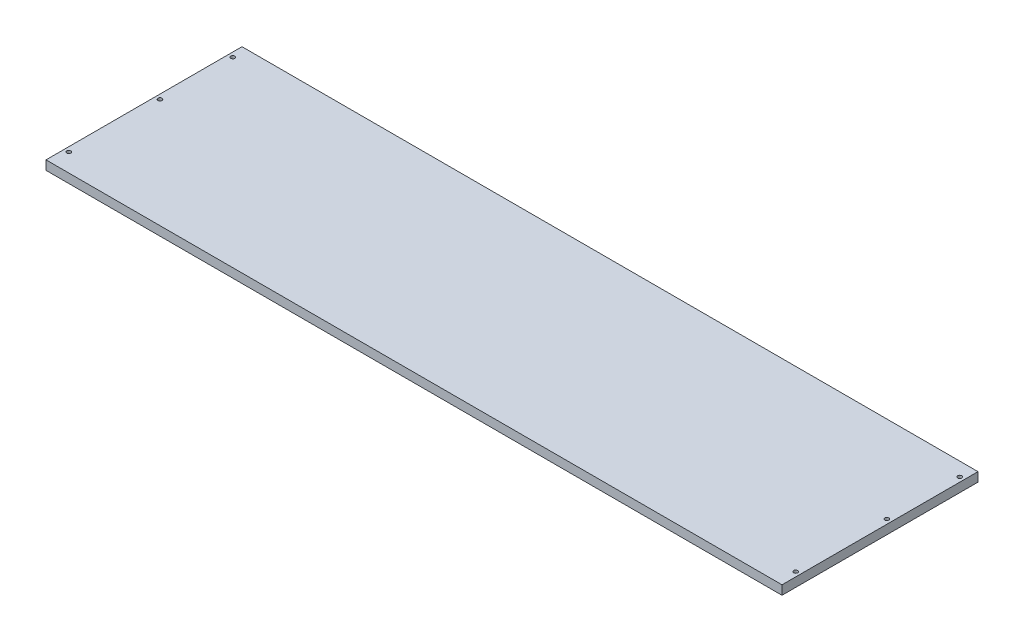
ISO-10303-21;
HEADER;
FILE_DESCRIPTION(('STEP AP214'),'2;1');
FILE_NAME('part.step','',(''),(''),'','','');
FILE_SCHEMA(('AUTOMOTIVE_DESIGN { 1 0 10303 214 1 1 1 1 }'));
ENDSEC;
DATA;
#1=APPLICATION_CONTEXT('core data for automotive mechanical design processes');
#2=APPLICATION_PROTOCOL_DEFINITION('international standard','automotive_design',2000,#1);
#3=PRODUCT_CONTEXT('',#1,'mechanical');
#4=PRODUCT('Part','Part','',(#3));
#5=PRODUCT_RELATED_PRODUCT_CATEGORY('part','',(#4));
#6=PRODUCT_DEFINITION_FORMATION('','',#4);
#7=PRODUCT_DEFINITION_CONTEXT('part definition',#1,'design');
#8=PRODUCT_DEFINITION('design','',#6,#7);
#9=PRODUCT_DEFINITION_SHAPE('','',#8);
#10=(LENGTH_UNIT() NAMED_UNIT(*) SI_UNIT(.MILLI.,.METRE.));
#11=(NAMED_UNIT(*) PLANE_ANGLE_UNIT() SI_UNIT($,.RADIAN.));
#12=(NAMED_UNIT(*) SI_UNIT($,.STERADIAN.) SOLID_ANGLE_UNIT());
#13=UNCERTAINTY_MEASURE_WITH_UNIT(LENGTH_MEASURE(1.E-05),#10,'distance_accuracy_value','');
#14=(GEOMETRIC_REPRESENTATION_CONTEXT(3) GLOBAL_UNCERTAINTY_ASSIGNED_CONTEXT((#13)) GLOBAL_UNIT_ASSIGNED_CONTEXT((#10,
#11,#12)) REPRESENTATION_CONTEXT('',''));
#15=CARTESIAN_POINT('',(0.,0.,0.));
#16=DIRECTION('',(0.,0.,1.));
#17=DIRECTION('',(1.,0.,0.));
#18=AXIS2_PLACEMENT_3D('',#15,#16,#17);
#19=CARTESIAN_POINT('',(0.,12.7,0.));
#20=DIRECTION('',(1.,0.,0.));
#21=DIRECTION('',(0.,0.,-1.));
#22=AXIS2_PLACEMENT_3D('',#19,#20,#21);
#23=PLANE('',#22);
#24=DIRECTION('',(0.,0.,1.));
#25=VECTOR('',#24,1.);
#26=CARTESIAN_POINT('',(0.,12.7,0.));
#27=LINE('',#26,#25);
#28=CARTESIAN_POINT('',(0.,12.7,-273.05));
#29=VERTEX_POINT('',#28);
#30=CARTESIAN_POINT('',(0.,12.7,0.));
#31=VERTEX_POINT('',#30);
#32=EDGE_CURVE('E84',#29,#31,#27,.T.);
#33=ORIENTED_EDGE('',*,*,#32,.F.);
#34=DIRECTION('',(0.,-1.,0.));
#35=VECTOR('',#34,1.);
#36=CARTESIAN_POINT('',(0.,12.7,-273.05));
#37=LINE('',#36,#35);
#38=CARTESIAN_POINT('',(0.,0.,-273.05));
#39=VERTEX_POINT('',#38);
#40=EDGE_CURVE('E125',#29,#39,#37,.T.);
#41=ORIENTED_EDGE('',*,*,#40,.T.);
#42=DIRECTION('',(0.,0.,1.));
#43=VECTOR('',#42,1.);
#44=CARTESIAN_POINT('',(0.,0.,0.));
#45=LINE('',#44,#43);
#46=CARTESIAN_POINT('',(0.,0.,0.));
#47=VERTEX_POINT('',#46);
#48=EDGE_CURVE('E75',#39,#47,#45,.T.);
#49=ORIENTED_EDGE('',*,*,#48,.T.);
#50=DIRECTION('',(0.,-1.,0.));
#51=VECTOR('',#50,1.);
#52=CARTESIAN_POINT('',(0.,12.7,0.));
#53=LINE('',#52,#51);
#54=EDGE_CURVE('E37',#31,#47,#53,.T.);
#55=ORIENTED_EDGE('',*,*,#54,.F.);
#56=EDGE_LOOP('',(#33,#41,#49,#55));
#57=FACE_BOUND('',#56,.T.);
#58=ADVANCED_FACE('F30',(#57),#23,.F.);
#59=CARTESIAN_POINT('',(0.,12.7,0.));
#60=DIRECTION('',(0.,0.,-1.));
#61=DIRECTION('',(-1.,0.,0.));
#62=AXIS2_PLACEMENT_3D('',#59,#60,#61);
#63=PLANE('',#62);
#64=DIRECTION('',(1.,0.,0.));
#65=VECTOR('',#64,1.);
#66=CARTESIAN_POINT('',(0.,0.,0.));
#67=LINE('',#66,#65);
#68=CARTESIAN_POINT('',(1025.398,0.,0.));
#69=VERTEX_POINT('',#68);
#70=EDGE_CURVE('E65',#47,#69,#67,.T.);
#71=ORIENTED_EDGE('',*,*,#70,.T.);
#72=DIRECTION('',(0.,-1.,0.));
#73=VECTOR('',#72,1.);
#74=CARTESIAN_POINT('',(1025.398,12.7,0.));
#75=LINE('',#74,#73);
#76=CARTESIAN_POINT('',(1025.398,12.7,0.));
#77=VERTEX_POINT('',#76);
#78=EDGE_CURVE('E68',#77,#69,#75,.T.);
#79=ORIENTED_EDGE('',*,*,#78,.F.);
#80=DIRECTION('',(1.,0.,0.));
#81=VECTOR('',#80,1.);
#82=CARTESIAN_POINT('',(0.,12.7,0.));
#83=LINE('',#82,#81);
#84=EDGE_CURVE('E52',#31,#77,#83,.T.);
#85=ORIENTED_EDGE('',*,*,#84,.F.);
#86=ORIENTED_EDGE('',*,*,#54,.T.);
#87=EDGE_LOOP('',(#71,#79,#85,#86));
#88=FACE_BOUND('',#87,.T.);
#89=ADVANCED_FACE('F67',(#88),#63,.F.);
#90=CARTESIAN_POINT('',(1025.398,12.7,0.));
#91=DIRECTION('',(-1.,0.,0.));
#92=DIRECTION('',(0.,0.,1.));
#93=AXIS2_PLACEMENT_3D('',#90,#91,#92);
#94=PLANE('',#93);
#95=DIRECTION('',(0.,0.,-1.));
#96=VECTOR('',#95,1.);
#97=CARTESIAN_POINT('',(1025.398,0.,0.));
#98=LINE('',#97,#96);
#99=CARTESIAN_POINT('',(1025.398,0.,-273.05));
#100=VERTEX_POINT('',#99);
#101=EDGE_CURVE('E74',#69,#100,#98,.T.);
#102=ORIENTED_EDGE('',*,*,#101,.T.);
#103=DIRECTION('',(0.,1.,0.));
#104=VECTOR('',#103,1.);
#105=CARTESIAN_POINT('',(1025.398,12.7,-273.05));
#106=LINE('',#105,#104);
#107=CARTESIAN_POINT('',(1025.398,12.7,-273.05));
#108=VERTEX_POINT('',#107);
#109=EDGE_CURVE('E43',#100,#108,#106,.T.);
#110=ORIENTED_EDGE('',*,*,#109,.T.);
#111=DIRECTION('',(0.,0.,-1.));
#112=VECTOR('',#111,1.);
#113=CARTESIAN_POINT('',(1025.398,12.7,0.));
#114=LINE('',#113,#112);
#115=EDGE_CURVE('E80',#77,#108,#114,.T.);
#116=ORIENTED_EDGE('',*,*,#115,.F.);
#117=ORIENTED_EDGE('',*,*,#78,.T.);
#118=EDGE_LOOP('',(#102,#110,#116,#117));
#119=FACE_BOUND('',#118,.T.);
#120=ADVANCED_FACE('F79',(#119),#94,.F.);
#121=CARTESIAN_POINT('',(0.,12.7,-304.8));
#122=DIRECTION('',(0.,-1.,0.));
#123=DIRECTION('',(0.,0.,-1.));
#124=AXIS2_PLACEMENT_3D('',#121,#122,#123);
#125=PLANE('',#124);
#126=CARTESIAN_POINT('',(6.35000000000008,12.7,-25.3999999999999));
#127=DIRECTION('',(0.,1.,0.));
#128=DIRECTION('',(0.,0.,1.));
#129=AXIS2_PLACEMENT_3D('',#126,#127,#128);
#130=CIRCLE('',#129,2.80669999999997);
#131=CARTESIAN_POINT('',(6.35000000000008,12.7,-22.5932999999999));
#132=VERTEX_POINT('',#131);
#133=EDGE_CURVE('E122',#132,#132,#130,.T.);
#134=ORIENTED_EDGE('',*,*,#133,.F.);
#135=EDGE_LOOP('',(#134));
#136=FACE_BOUND('',#135,.T.);
#137=CARTESIAN_POINT('',(1019.048,12.7,-25.3999999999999));
#138=DIRECTION('',(0.,1.,0.));
#139=DIRECTION('',(0.,0.,-1.));
#140=AXIS2_PLACEMENT_3D('',#137,#138,#139);
#141=CIRCLE('',#140,2.80669999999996);
#142=CARTESIAN_POINT('',(1019.048,12.7,-28.2066999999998));
#143=VERTEX_POINT('',#142);
#144=EDGE_CURVE('E116',#143,#143,#141,.T.);
#145=ORIENTED_EDGE('',*,*,#144,.F.);
#146=EDGE_LOOP('',(#145));
#147=FACE_BOUND('',#146,.T.);
#148=CARTESIAN_POINT('',(6.3500000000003,12.7,-254.));
#149=DIRECTION('',(0.,1.,0.));
#150=DIRECTION('',(0.,0.,-1.));
#151=AXIS2_PLACEMENT_3D('',#148,#149,#150);
#152=CIRCLE('',#151,2.80669999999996);
#153=CARTESIAN_POINT('',(6.3500000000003,12.7,-256.8067));
#154=VERTEX_POINT('',#153);
#155=EDGE_CURVE('E110',#154,#154,#152,.T.);
#156=ORIENTED_EDGE('',*,*,#155,.F.);
#157=EDGE_LOOP('',(#156));
#158=FACE_BOUND('',#157,.T.);
#159=CARTESIAN_POINT('',(6.3500000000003,12.7,-152.4));
#160=DIRECTION('',(0.,1.,0.));
#161=DIRECTION('',(0.,0.,-1.));
#162=AXIS2_PLACEMENT_3D('',#159,#160,#161);
#163=CIRCLE('',#162,2.80669999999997);
#164=CARTESIAN_POINT('',(6.3500000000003,12.7,-155.2067));
#165=VERTEX_POINT('',#164);
#166=EDGE_CURVE('E104',#165,#165,#163,.T.);
#167=ORIENTED_EDGE('',*,*,#166,.F.);
#168=EDGE_LOOP('',(#167));
#169=FACE_BOUND('',#168,.T.);
#170=CARTESIAN_POINT('',(1019.048,12.7,-152.4));
#171=DIRECTION('',(0.,1.,0.));
#172=DIRECTION('',(0.,0.,1.));
#173=AXIS2_PLACEMENT_3D('',#170,#171,#172);
#174=CIRCLE('',#173,2.80669999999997);
#175=CARTESIAN_POINT('',(1019.048,12.7,-149.5933));
#176=VERTEX_POINT('',#175);
#177=EDGE_CURVE('E98',#176,#176,#174,.T.);
#178=ORIENTED_EDGE('',*,*,#177,.F.);
#179=EDGE_LOOP('',(#178));
#180=FACE_BOUND('',#179,.T.);
#181=CARTESIAN_POINT('',(1019.048,12.7,-254.));
#182=DIRECTION('',(0.,1.,0.));
#183=DIRECTION('',(0.,0.,1.));
#184=AXIS2_PLACEMENT_3D('',#181,#182,#183);
#185=CIRCLE('',#184,2.80669999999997);
#186=CARTESIAN_POINT('',(1019.048,12.7,-251.1933));
#187=VERTEX_POINT('',#186);
#188=EDGE_CURVE('E92',#187,#187,#185,.T.);
#189=ORIENTED_EDGE('',*,*,#188,.F.);
#190=EDGE_LOOP('',(#189));
#191=FACE_BOUND('',#190,.T.);
#192=ORIENTED_EDGE('',*,*,#115,.T.);
#193=DIRECTION('',(1.,0.,0.));
#194=VECTOR('',#193,1.);
#195=CARTESIAN_POINT('',(-28.3688009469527,12.7,-273.05));
#196=LINE('',#195,#194);
#197=EDGE_CURVE('E131',#29,#108,#196,.T.);
#198=ORIENTED_EDGE('',*,*,#197,.F.);
#199=ORIENTED_EDGE('',*,*,#32,.T.);
#200=ORIENTED_EDGE('',*,*,#84,.T.);
#201=EDGE_LOOP('',(#192,#198,#199,#200));
#202=FACE_BOUND('',#201,.T.);
#203=ADVANCED_FACE('F139',(#136,#147,#158,#169,#180,#191,#202),#125,.F.);
#204=CARTESIAN_POINT('',(0.,0.,-304.8));
#205=DIRECTION('',(0.,-1.,0.));
#206=DIRECTION('',(0.,0.,-1.));
#207=AXIS2_PLACEMENT_3D('',#204,#205,#206);
#208=PLANE('',#207);
#209=DIRECTION('',(-1.,0.,0.));
#210=VECTOR('',#209,1.);
#211=CARTESIAN_POINT('',(0.,0.,-273.05));
#212=LINE('',#211,#210);
#213=EDGE_CURVE('E11',#100,#39,#212,.T.);
#214=ORIENTED_EDGE('',*,*,#213,.F.);
#215=ORIENTED_EDGE('',*,*,#101,.F.);
#216=ORIENTED_EDGE('',*,*,#70,.F.);
#217=ORIENTED_EDGE('',*,*,#48,.F.);
#218=EDGE_LOOP('',(#214,#215,#216,#217));
#219=FACE_BOUND('',#218,.T.);
#220=CARTESIAN_POINT('',(6.35000000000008,0.,-25.3999999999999));
#221=DIRECTION('',(0.,1.,0.));
#222=DIRECTION('',(0.,0.,1.));
#223=AXIS2_PLACEMENT_3D('',#220,#221,#222);
#224=CIRCLE('',#223,2.80669999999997);
#225=CARTESIAN_POINT('',(6.35000000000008,0.,-22.5932999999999));
#226=VERTEX_POINT('',#225);
#227=EDGE_CURVE('E119',#226,#226,#224,.T.);
#228=ORIENTED_EDGE('',*,*,#227,.T.);
#229=EDGE_LOOP('',(#228));
#230=FACE_BOUND('',#229,.T.);
#231=CARTESIAN_POINT('',(1019.048,0.,-25.3999999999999));
#232=DIRECTION('',(0.,1.,0.));
#233=DIRECTION('',(0.,0.,-1.));
#234=AXIS2_PLACEMENT_3D('',#231,#232,#233);
#235=CIRCLE('',#234,2.80669999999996);
#236=CARTESIAN_POINT('',(1019.048,0.,-28.2066999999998));
#237=VERTEX_POINT('',#236);
#238=EDGE_CURVE('E113',#237,#237,#235,.T.);
#239=ORIENTED_EDGE('',*,*,#238,.T.);
#240=EDGE_LOOP('',(#239));
#241=FACE_BOUND('',#240,.T.);
#242=CARTESIAN_POINT('',(6.3500000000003,0.,-254.));
#243=DIRECTION('',(0.,1.,0.));
#244=DIRECTION('',(0.,0.,-1.));
#245=AXIS2_PLACEMENT_3D('',#242,#243,#244);
#246=CIRCLE('',#245,2.80669999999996);
#247=CARTESIAN_POINT('',(6.3500000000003,0.,-256.8067));
#248=VERTEX_POINT('',#247);
#249=EDGE_CURVE('E107',#248,#248,#246,.T.);
#250=ORIENTED_EDGE('',*,*,#249,.T.);
#251=EDGE_LOOP('',(#250));
#252=FACE_BOUND('',#251,.T.);
#253=CARTESIAN_POINT('',(6.3500000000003,0.,-152.4));
#254=DIRECTION('',(0.,1.,0.));
#255=DIRECTION('',(0.,0.,-1.));
#256=AXIS2_PLACEMENT_3D('',#253,#254,#255);
#257=CIRCLE('',#256,2.80669999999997);
#258=CARTESIAN_POINT('',(6.3500000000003,0.,-155.2067));
#259=VERTEX_POINT('',#258);
#260=EDGE_CURVE('E101',#259,#259,#257,.T.);
#261=ORIENTED_EDGE('',*,*,#260,.T.);
#262=EDGE_LOOP('',(#261));
#263=FACE_BOUND('',#262,.T.);
#264=CARTESIAN_POINT('',(1019.048,0.,-152.4));
#265=DIRECTION('',(0.,1.,0.));
#266=DIRECTION('',(0.,0.,1.));
#267=AXIS2_PLACEMENT_3D('',#264,#265,#266);
#268=CIRCLE('',#267,2.80669999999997);
#269=CARTESIAN_POINT('',(1019.048,0.,-149.5933));
#270=VERTEX_POINT('',#269);
#271=EDGE_CURVE('E95',#270,#270,#268,.T.);
#272=ORIENTED_EDGE('',*,*,#271,.T.);
#273=EDGE_LOOP('',(#272));
#274=FACE_BOUND('',#273,.T.);
#275=CARTESIAN_POINT('',(1019.048,0.,-254.));
#276=DIRECTION('',(0.,1.,0.));
#277=DIRECTION('',(0.,0.,1.));
#278=AXIS2_PLACEMENT_3D('',#275,#276,#277);
#279=CIRCLE('',#278,2.80669999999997);
#280=CARTESIAN_POINT('',(1019.048,0.,-251.1933));
#281=VERTEX_POINT('',#280);
#282=EDGE_CURVE('E89',#281,#281,#279,.T.);
#283=ORIENTED_EDGE('',*,*,#282,.T.);
#284=EDGE_LOOP('',(#283));
#285=FACE_BOUND('',#284,.T.);
#286=ADVANCED_FACE('F82',(#219,#230,#241,#252,#263,#274,#285),#208,.T.);
#287=CARTESIAN_POINT('',(1019.048,0.,-254.));
#288=DIRECTION('',(0.,1.,0.));
#289=DIRECTION('',(0.,0.,1.));
#290=AXIS2_PLACEMENT_3D('',#287,#288,#289);
#291=CYLINDRICAL_SURFACE('',#290,2.80669999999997);
#292=ORIENTED_EDGE('',*,*,#282,.F.);
#293=EDGE_LOOP('',(#292));
#294=FACE_BOUND('',#293,.T.);
#295=ORIENTED_EDGE('',*,*,#188,.T.);
#296=EDGE_LOOP('',(#295));
#297=FACE_BOUND('',#296,.T.);
#298=ADVANCED_FACE('F147',(#294,#297),#291,.F.);
#299=CARTESIAN_POINT('',(1019.048,0.,-152.4));
#300=DIRECTION('',(0.,1.,0.));
#301=DIRECTION('',(0.,0.,1.));
#302=AXIS2_PLACEMENT_3D('',#299,#300,#301);
#303=CYLINDRICAL_SURFACE('',#302,2.80669999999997);
#304=ORIENTED_EDGE('',*,*,#271,.F.);
#305=EDGE_LOOP('',(#304));
#306=FACE_BOUND('',#305,.T.);
#307=ORIENTED_EDGE('',*,*,#177,.T.);
#308=EDGE_LOOP('',(#307));
#309=FACE_BOUND('',#308,.T.);
#310=ADVANCED_FACE('F178',(#306,#309),#303,.F.);
#311=CARTESIAN_POINT('',(6.3500000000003,0.,-152.4));
#312=DIRECTION('',(0.,1.,0.));
#313=DIRECTION('',(0.,0.,1.));
#314=AXIS2_PLACEMENT_3D('',#311,#312,#313);
#315=CYLINDRICAL_SURFACE('',#314,2.80669999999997);
#316=ORIENTED_EDGE('',*,*,#260,.F.);
#317=EDGE_LOOP('',(#316));
#318=FACE_BOUND('',#317,.T.);
#319=ORIENTED_EDGE('',*,*,#166,.T.);
#320=EDGE_LOOP('',(#319));
#321=FACE_BOUND('',#320,.T.);
#322=ADVANCED_FACE('F185',(#318,#321),#315,.F.);
#323=CARTESIAN_POINT('',(6.3500000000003,0.,-254.));
#324=DIRECTION('',(0.,1.,0.));
#325=DIRECTION('',(0.,0.,1.));
#326=AXIS2_PLACEMENT_3D('',#323,#324,#325);
#327=CYLINDRICAL_SURFACE('',#326,2.80669999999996);
#328=ORIENTED_EDGE('',*,*,#249,.F.);
#329=EDGE_LOOP('',(#328));
#330=FACE_BOUND('',#329,.T.);
#331=ORIENTED_EDGE('',*,*,#155,.T.);
#332=EDGE_LOOP('',(#331));
#333=FACE_BOUND('',#332,.T.);
#334=ADVANCED_FACE('F193',(#330,#333),#327,.F.);
#335=CARTESIAN_POINT('',(1019.048,0.,-25.3999999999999));
#336=DIRECTION('',(0.,1.,0.));
#337=DIRECTION('',(0.,0.,1.));
#338=AXIS2_PLACEMENT_3D('',#335,#336,#337);
#339=CYLINDRICAL_SURFACE('',#338,2.80669999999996);
#340=ORIENTED_EDGE('',*,*,#238,.F.);
#341=EDGE_LOOP('',(#340));
#342=FACE_BOUND('',#341,.T.);
#343=ORIENTED_EDGE('',*,*,#144,.T.);
#344=EDGE_LOOP('',(#343));
#345=FACE_BOUND('',#344,.T.);
#346=ADVANCED_FACE('F201',(#342,#345),#339,.F.);
#347=CARTESIAN_POINT('',(6.35000000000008,0.,-25.3999999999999));
#348=DIRECTION('',(0.,1.,0.));
#349=DIRECTION('',(0.,0.,1.));
#350=AXIS2_PLACEMENT_3D('',#347,#348,#349);
#351=CYLINDRICAL_SURFACE('',#350,2.80669999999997);
#352=ORIENTED_EDGE('',*,*,#227,.F.);
#353=EDGE_LOOP('',(#352));
#354=FACE_BOUND('',#353,.T.);
#355=ORIENTED_EDGE('',*,*,#133,.T.);
#356=EDGE_LOOP('',(#355));
#357=FACE_BOUND('',#356,.T.);
#358=ADVANCED_FACE('F209',(#354,#357),#351,.F.);
#359=CARTESIAN_POINT('',(-28.3688009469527,0.,-273.05));
#360=DIRECTION('',(0.,0.,1.));
#361=DIRECTION('',(1.,0.,0.));
#362=AXIS2_PLACEMENT_3D('',#359,#360,#361);
#363=PLANE('',#362);
#364=ORIENTED_EDGE('',*,*,#197,.T.);
#365=ORIENTED_EDGE('',*,*,#109,.F.);
#366=ORIENTED_EDGE('',*,*,#213,.T.);
#367=ORIENTED_EDGE('',*,*,#40,.F.);
#368=EDGE_LOOP('',(#364,#365,#366,#367));
#369=FACE_BOUND('',#368,.T.);
#370=ADVANCED_FACE('F135',(#369),#363,.F.);
#371=CLOSED_SHELL('',(#58,#89,#120,#203,#286,#298,#310,#322,#334,#346,#358,#370));
#372=MANIFOLD_SOLID_BREP('B2',#371);
#373=ADVANCED_BREP_SHAPE_REPRESENTATION('',(#18,#372),#14);
#374=SHAPE_DEFINITION_REPRESENTATION(#9,#373);
ENDSEC;
END-ISO-10303-21;
